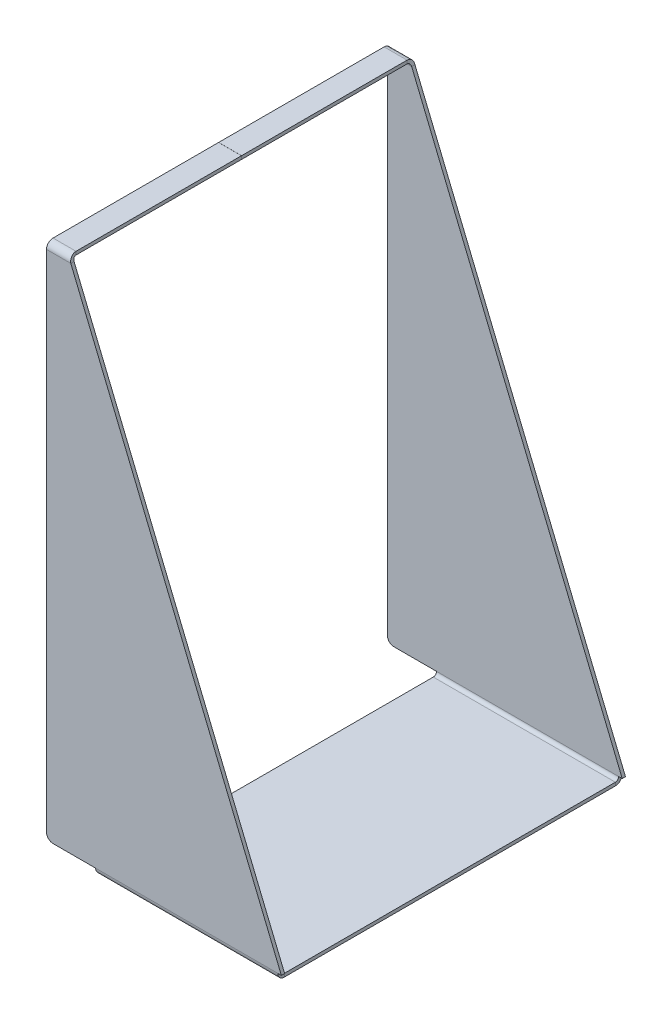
ISO-10303-21;
HEADER;
FILE_DESCRIPTION(('STEP AP214'),'2;1');
FILE_NAME('part.step','',(''),(''),'','','');
FILE_SCHEMA(('AUTOMOTIVE_DESIGN { 1 0 10303 214 1 1 1 1 }'));
ENDSEC;
DATA;
#1=APPLICATION_CONTEXT('core data for automotive mechanical design processes');
#2=APPLICATION_PROTOCOL_DEFINITION('international standard','automotive_design',2000,#1);
#3=PRODUCT_CONTEXT('',#1,'mechanical');
#4=PRODUCT('Part','Part','',(#3));
#5=PRODUCT_RELATED_PRODUCT_CATEGORY('part','',(#4));
#6=PRODUCT_DEFINITION_FORMATION('','',#4);
#7=PRODUCT_DEFINITION_CONTEXT('part definition',#1,'design');
#8=PRODUCT_DEFINITION('design','',#6,#7);
#9=PRODUCT_DEFINITION_SHAPE('','',#8);
#10=(LENGTH_UNIT() NAMED_UNIT(*) SI_UNIT(.MILLI.,.METRE.));
#11=(NAMED_UNIT(*) PLANE_ANGLE_UNIT() SI_UNIT($,.RADIAN.));
#12=(NAMED_UNIT(*) SI_UNIT($,.STERADIAN.) SOLID_ANGLE_UNIT());
#13=UNCERTAINTY_MEASURE_WITH_UNIT(LENGTH_MEASURE(1.E-05),#10,'distance_accuracy_value','');
#14=(GEOMETRIC_REPRESENTATION_CONTEXT(3) GLOBAL_UNCERTAINTY_ASSIGNED_CONTEXT((#13)) GLOBAL_UNIT_ASSIGNED_CONTEXT((#10,
#11,#12)) REPRESENTATION_CONTEXT('',''));
#15=CARTESIAN_POINT('',(0.,0.,0.));
#16=DIRECTION('',(0.,0.,1.));
#17=DIRECTION('',(1.,0.,0.));
#18=AXIS2_PLACEMENT_3D('',#15,#16,#17);
#19=CARTESIAN_POINT('',(-39.8627868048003,-79.1903749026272,103.));
#20=DIRECTION('',(0.,1.,0.));
#21=DIRECTION('',(-1.,0.,0.));
#22=AXIS2_PLACEMENT_3D('',#19,#20,#21);
#23=PLANE('',#22);
#24=DIRECTION('',(0.,0.,1.));
#25=VECTOR('',#24,1.);
#26=CARTESIAN_POINT('',(30.696036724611,-79.1903749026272,103.));
#27=LINE('',#26,#25);
#28=CARTESIAN_POINT('',(30.696036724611,-79.1903749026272,1.));
#29=VERTEX_POINT('',#28);
#30=CARTESIAN_POINT('',(30.696036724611,-79.1903749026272,102.));
#31=VERTEX_POINT('',#30);
#32=EDGE_CURVE('E326',#29,#31,#27,.T.);
#33=ORIENTED_EDGE('',*,*,#32,.T.);
#34=DIRECTION('',(-1.,0.,0.));
#35=VECTOR('',#34,1.);
#36=CARTESIAN_POINT('',(-39.8627868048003,-79.1903749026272,102.));
#37=LINE('',#36,#35);
#38=CARTESIAN_POINT('',(-24.8627868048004,-79.1903749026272,102.));
#39=VERTEX_POINT('',#38);
#40=EDGE_CURVE('E336',#31,#39,#37,.T.);
#41=ORIENTED_EDGE('',*,*,#40,.T.);
#42=DIRECTION('',(0.,0.,-1.));
#43=VECTOR('',#42,1.);
#44=CARTESIAN_POINT('',(-24.8627868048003,-79.1903749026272,106.5));
#45=LINE('',#44,#43);
#46=CARTESIAN_POINT('',(-24.8627868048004,-79.1903749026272,1.));
#47=VERTEX_POINT('',#46);
#48=EDGE_CURVE('E329',#39,#47,#45,.T.);
#49=ORIENTED_EDGE('',*,*,#48,.T.);
#50=DIRECTION('',(1.,0.,0.));
#51=VECTOR('',#50,1.);
#52=CARTESIAN_POINT('',(-39.8627868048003,-79.1903749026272,1.));
#53=LINE('',#52,#51);
#54=EDGE_CURVE('E347',#47,#29,#53,.T.);
#55=ORIENTED_EDGE('',*,*,#54,.T.);
#56=EDGE_LOOP('',(#33,#41,#49,#55));
#57=FACE_BOUND('',#56,.T.);
#58=ADVANCED_FACE('F68',(#57),#23,.F.);
#59=CARTESIAN_POINT('',(-39.8627868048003,-78.1903749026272,103.));
#60=DIRECTION('',(0.,1.,0.));
#61=DIRECTION('',(-1.,0.,0.));
#62=AXIS2_PLACEMENT_3D('',#59,#60,#61);
#63=PLANE('',#62);
#64=DIRECTION('',(-1.,0.,0.));
#65=VECTOR('',#64,1.);
#66=CARTESIAN_POINT('',(-39.8627868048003,-78.1903749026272,102.));
#67=LINE('',#66,#65);
#68=CARTESIAN_POINT('',(30.696036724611,-78.1903749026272,102.));
#69=VERTEX_POINT('',#68);
#70=CARTESIAN_POINT('',(-24.8627868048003,-78.1903749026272,102.));
#71=VERTEX_POINT('',#70);
#72=EDGE_CURVE('E341',#69,#71,#67,.T.);
#73=ORIENTED_EDGE('',*,*,#72,.F.);
#74=DIRECTION('',(0.,0.,1.));
#75=VECTOR('',#74,1.);
#76=CARTESIAN_POINT('',(30.696036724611,-78.1903749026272,104.356194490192));
#77=LINE('',#76,#75);
#78=CARTESIAN_POINT('',(30.696036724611,-78.1903749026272,1.));
#79=VERTEX_POINT('',#78);
#80=EDGE_CURVE('E320',#79,#69,#77,.T.);
#81=ORIENTED_EDGE('',*,*,#80,.F.);
#82=DIRECTION('',(1.,0.,0.));
#83=VECTOR('',#82,1.);
#84=CARTESIAN_POINT('',(32.196036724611,-78.1903749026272,1.));
#85=LINE('',#84,#83);
#86=CARTESIAN_POINT('',(-24.8627868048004,-78.1903749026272,1.));
#87=VERTEX_POINT('',#86);
#88=EDGE_CURVE('E352',#87,#79,#85,.T.);
#89=ORIENTED_EDGE('',*,*,#88,.F.);
#90=DIRECTION('',(0.,0.,1.));
#91=VECTOR('',#90,1.);
#92=CARTESIAN_POINT('',(-24.8627868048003,-78.1903749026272,103.));
#93=LINE('',#92,#91);
#94=EDGE_CURVE('E333',#87,#71,#93,.T.);
#95=ORIENTED_EDGE('',*,*,#94,.T.);
#96=EDGE_LOOP('',(#73,#81,#89,#95));
#97=FACE_BOUND('',#96,.T.);
#98=ADVANCED_FACE('F507',(#97),#63,.T.);
#99=CARTESIAN_POINT('',(-24.8627868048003,-77.1903749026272,106.5));
#100=DIRECTION('',(-1.,0.,0.));
#101=DIRECTION('',(0.,0.,1.));
#102=AXIS2_PLACEMENT_3D('',#99,#100,#101);
#103=PLANE('',#102);
#104=DIRECTION('',(0.,1.,0.));
#105=VECTOR('',#104,1.);
#106=CARTESIAN_POINT('',(-24.8627868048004,-79.1903749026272,1.));
#107=LINE('',#106,#105);
#108=EDGE_CURVE('E349',#47,#87,#107,.T.);
#109=ORIENTED_EDGE('',*,*,#108,.F.);
#110=ORIENTED_EDGE('',*,*,#48,.F.);
#111=DIRECTION('',(0.,1.,0.));
#112=VECTOR('',#111,1.);
#113=CARTESIAN_POINT('',(-24.8627868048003,-79.1903749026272,102.));
#114=LINE('',#113,#112);
#115=EDGE_CURVE('E344',#39,#71,#114,.T.);
#116=ORIENTED_EDGE('',*,*,#115,.T.);
#117=ORIENTED_EDGE('',*,*,#94,.F.);
#118=EDGE_LOOP('',(#109,#110,#116,#117));
#119=FACE_BOUND('',#118,.T.);
#120=ADVANCED_FACE('F484',(#119),#103,.T.);
#121=CARTESIAN_POINT('',(30.696036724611,-78.1903749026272,104.356194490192));
#122=DIRECTION('',(-1.,0.,0.));
#123=DIRECTION('',(0.,0.,1.));
#124=AXIS2_PLACEMENT_3D('',#121,#122,#123);
#125=PLANE('',#124);
#126=ORIENTED_EDGE('',*,*,#80,.T.);
#127=DIRECTION('',(0.,1.,0.));
#128=VECTOR('',#127,1.);
#129=CARTESIAN_POINT('',(30.696036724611,-79.1903749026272,102.));
#130=LINE('',#129,#128);
#131=EDGE_CURVE('E339',#31,#69,#130,.T.);
#132=ORIENTED_EDGE('',*,*,#131,.F.);
#133=ORIENTED_EDGE('',*,*,#32,.F.);
#134=DIRECTION('',(0.,-1.,0.));
#135=VECTOR('',#134,1.);
#136=CARTESIAN_POINT('',(30.696036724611,-78.1903749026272,1.));
#137=LINE('',#136,#135);
#138=EDGE_CURVE('E355',#79,#29,#137,.T.);
#139=ORIENTED_EDGE('',*,*,#138,.F.);
#140=EDGE_LOOP('',(#126,#132,#133,#139));
#141=FACE_BOUND('',#140,.T.);
#142=ADVANCED_FACE('F515',(#141),#125,.F.);
#143=CARTESIAN_POINT('',(30.696036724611,-77.1903749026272,102.));
#144=DIRECTION('',(1.,0.,0.));
#145=DIRECTION('',(0.,0.,-1.));
#146=AXIS2_PLACEMENT_3D('',#143,#144,#145);
#147=PLANE('',#146);
#148=ORIENTED_EDGE('',*,*,#131,.T.);
#149=CARTESIAN_POINT('',(30.696036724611,-77.1903749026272,102.));
#150=DIRECTION('',(-1.,0.,0.));
#151=DIRECTION('',(0.,-1.,0.));
#152=AXIS2_PLACEMENT_3D('',#149,#150,#151);
#153=CIRCLE('',#152,1.);
#154=CARTESIAN_POINT('',(30.696036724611,-77.1903749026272,103.));
#155=VERTEX_POINT('',#154);
#156=EDGE_CURVE('E321',#69,#155,#153,.T.);
#157=ORIENTED_EDGE('',*,*,#156,.T.);
#158=DIRECTION('',(0.,0.,-1.));
#159=VECTOR('',#158,1.);
#160=CARTESIAN_POINT('',(30.696036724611,-77.1903749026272,104.));
#161=LINE('',#160,#159);
#162=CARTESIAN_POINT('',(30.696036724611,-77.1903749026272,104.));
#163=VERTEX_POINT('',#162);
#164=EDGE_CURVE('E453',#163,#155,#161,.T.);
#165=ORIENTED_EDGE('',*,*,#164,.F.);
#166=CARTESIAN_POINT('',(30.696036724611,-77.1903749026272,102.));
#167=DIRECTION('',(-1.,0.,0.));
#168=DIRECTION('',(0.,0.,-1.));
#169=AXIS2_PLACEMENT_3D('',#166,#167,#168);
#170=CIRCLE('',#169,1.99999999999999);
#171=EDGE_CURVE('E313',#31,#163,#170,.T.);
#172=ORIENTED_EDGE('',*,*,#171,.F.);
#173=EDGE_LOOP('',(#148,#157,#165,#172));
#174=FACE_BOUND('',#173,.T.);
#175=ADVANCED_FACE('F475',(#174),#147,.T.);
#176=CARTESIAN_POINT('',(-24.8627868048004,-77.1903749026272,102.));
#177=DIRECTION('',(-1.,0.,0.));
#178=DIRECTION('',(0.,0.,1.));
#179=AXIS2_PLACEMENT_3D('',#176,#177,#178);
#180=PLANE('',#179);
#181=CARTESIAN_POINT('',(-24.8627868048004,-77.1903749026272,102.));
#182=DIRECTION('',(-1.,0.,0.));
#183=DIRECTION('',(0.,-1.,0.));
#184=AXIS2_PLACEMENT_3D('',#181,#182,#183);
#185=CIRCLE('',#184,1.);
#186=CARTESIAN_POINT('',(-24.8627868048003,-77.1903749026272,103.));
#187=VERTEX_POINT('',#186);
#188=EDGE_CURVE('E317',#187,#71,#185,.F.);
#189=ORIENTED_EDGE('',*,*,#188,.T.);
#190=ORIENTED_EDGE('',*,*,#115,.F.);
#191=CARTESIAN_POINT('',(-24.8627868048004,-77.1903749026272,102.));
#192=DIRECTION('',(1.,0.,0.));
#193=DIRECTION('',(0.,0.,-1.));
#194=AXIS2_PLACEMENT_3D('',#191,#192,#193);
#195=CIRCLE('',#194,2.);
#196=CARTESIAN_POINT('',(-24.8627868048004,-77.1903749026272,104.));
#197=VERTEX_POINT('',#196);
#198=EDGE_CURVE('E316',#197,#39,#195,.T.);
#199=ORIENTED_EDGE('',*,*,#198,.F.);
#200=DIRECTION('',(0.,0.,-1.));
#201=VECTOR('',#200,1.);
#202=CARTESIAN_POINT('',(-24.8627868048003,-77.1903749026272,106.5));
#203=LINE('',#202,#201);
#204=EDGE_CURVE('E309',#197,#187,#203,.T.);
#205=ORIENTED_EDGE('',*,*,#204,.T.);
#206=EDGE_LOOP('',(#189,#190,#199,#205));
#207=FACE_BOUND('',#206,.T.);
#208=ADVANCED_FACE('F990',(#207),#180,.T.);
#209=CARTESIAN_POINT('',(58.5343786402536,-77.1903749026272,102.));
#210=DIRECTION('',(-1.,0.,0.));
#211=DIRECTION('',(0.,-1.,0.));
#212=AXIS2_PLACEMENT_3D('',#209,#210,#211);
#213=CYLINDRICAL_SURFACE('',#212,2.);
#214=DIRECTION('',(1.,0.,0.));
#215=VECTOR('',#214,1.);
#216=CARTESIAN_POINT('',(0.,-77.1903749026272,104.));
#217=LINE('',#216,#215);
#218=EDGE_CURVE('E251',#197,#163,#217,.T.);
#219=ORIENTED_EDGE('',*,*,#218,.F.);
#220=ORIENTED_EDGE('',*,*,#198,.T.);
#221=ORIENTED_EDGE('',*,*,#40,.F.);
#222=ORIENTED_EDGE('',*,*,#171,.T.);
#223=EDGE_LOOP('',(#219,#220,#221,#222));
#224=FACE_BOUND('',#223,.T.);
#225=ADVANCED_FACE('F477',(#224),#213,.T.);
#226=CARTESIAN_POINT('',(58.5343786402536,-77.1903749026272,102.));
#227=DIRECTION('',(-1.,0.,0.));
#228=DIRECTION('',(0.,-1.,0.));
#229=AXIS2_PLACEMENT_3D('',#226,#227,#228);
#230=CYLINDRICAL_SURFACE('',#229,1.);
#231=DIRECTION('',(1.,0.,0.));
#232=VECTOR('',#231,1.);
#233=CARTESIAN_POINT('',(0.,-77.1903749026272,103.));
#234=LINE('',#233,#232);
#235=EDGE_CURVE('E305',#187,#155,#234,.T.);
#236=ORIENTED_EDGE('',*,*,#235,.T.);
#237=ORIENTED_EDGE('',*,*,#156,.F.);
#238=ORIENTED_EDGE('',*,*,#72,.T.);
#239=ORIENTED_EDGE('',*,*,#188,.F.);
#240=EDGE_LOOP('',(#236,#237,#238,#239));
#241=FACE_BOUND('',#240,.T.);
#242=ADVANCED_FACE('F529',(#241),#230,.F.);
#243=CARTESIAN_POINT('',(-30.8627868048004,79.8096250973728,51.51));
#244=DIRECTION('',(0.,0.,1.));
#245=DIRECTION('',(-1.,0.,0.));
#246=AXIS2_PLACEMENT_3D('',#243,#244,#245);
#247=PLANE('',#246);
#248=DIRECTION('',(0.,1.,0.));
#249=VECTOR('',#248,1.);
#250=CARTESIAN_POINT('',(-32.8627868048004,79.8096250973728,51.51));
#251=LINE('',#250,#249);
#252=CARTESIAN_POINT('',(-32.8627868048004,79.8096250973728,51.51));
#253=VERTEX_POINT('',#252);
#254=CARTESIAN_POINT('',(-32.8627868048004,80.8096250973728,51.51));
#255=VERTEX_POINT('',#254);
#256=EDGE_CURVE('E300',#253,#255,#251,.T.);
#257=ORIENTED_EDGE('',*,*,#256,.F.);
#258=DIRECTION('',(1.,0.,0.));
#259=VECTOR('',#258,1.);
#260=CARTESIAN_POINT('',(-30.8627868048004,79.8096250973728,51.51));
#261=LINE('',#260,#259);
#262=CARTESIAN_POINT('',(-39.8627868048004,79.8096250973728,51.51));
#263=VERTEX_POINT('',#262);
#264=EDGE_CURVE('E308',#253,#263,#261,.F.);
#265=ORIENTED_EDGE('',*,*,#264,.T.);
#266=DIRECTION('',(0.,-1.,0.));
#267=VECTOR('',#266,1.);
#268=CARTESIAN_POINT('',(-39.8627868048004,79.8096250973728,51.51));
#269=LINE('',#268,#267);
#270=CARTESIAN_POINT('',(-39.8627868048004,80.8096250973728,51.51));
#271=VERTEX_POINT('',#270);
#272=EDGE_CURVE('E304',#263,#271,#269,.F.);
#273=ORIENTED_EDGE('',*,*,#272,.T.);
#274=DIRECTION('',(1.,0.,0.));
#275=VECTOR('',#274,1.);
#276=CARTESIAN_POINT('',(-30.8627868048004,80.8096250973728,51.51));
#277=LINE('',#276,#275);
#278=EDGE_CURVE('E285',#255,#271,#277,.F.);
#279=ORIENTED_EDGE('',*,*,#278,.F.);
#280=EDGE_LOOP('',(#257,#265,#273,#279));
#281=FACE_BOUND('',#280,.T.);
#282=ADVANCED_FACE('F526',(#281),#247,.F.);
#283=CARTESIAN_POINT('',(-32.8627868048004,79.8096250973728,103.));
#284=DIRECTION('',(-1.,0.,0.));
#285=DIRECTION('',(0.,0.,-1.));
#286=AXIS2_PLACEMENT_3D('',#283,#284,#285);
#287=PLANE('',#286);
#288=DIRECTION('',(0.,1.,0.));
#289=VECTOR('',#288,1.);
#290=CARTESIAN_POINT('',(-32.8627868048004,79.8096250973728,102.));
#291=LINE('',#290,#289);
#292=CARTESIAN_POINT('',(-32.8627868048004,79.8096250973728,102.));
#293=VERTEX_POINT('',#292);
#294=CARTESIAN_POINT('',(-32.8627868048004,80.8096250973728,102.));
#295=VERTEX_POINT('',#294);
#296=EDGE_CURVE('E280',#293,#295,#291,.T.);
#297=ORIENTED_EDGE('',*,*,#296,.F.);
#298=DIRECTION('',(0.,0.,-1.));
#299=VECTOR('',#298,1.);
#300=CARTESIAN_POINT('',(-32.8627868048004,79.8096250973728,103.));
#301=LINE('',#300,#299);
#302=EDGE_CURVE('E301',#293,#253,#301,.T.);
#303=ORIENTED_EDGE('',*,*,#302,.T.);
#304=ORIENTED_EDGE('',*,*,#256,.T.);
#305=DIRECTION('',(0.,0.,-1.));
#306=VECTOR('',#305,1.);
#307=CARTESIAN_POINT('',(-32.8627868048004,80.8096250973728,103.));
#308=LINE('',#307,#306);
#309=EDGE_CURVE('E286',#295,#255,#308,.T.);
#310=ORIENTED_EDGE('',*,*,#309,.F.);
#311=EDGE_LOOP('',(#297,#303,#304,#310));
#312=FACE_BOUND('',#311,.T.);
#313=ADVANCED_FACE('F528',(#312),#287,.F.);
#314=CARTESIAN_POINT('',(-39.8627868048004,78.8096250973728,102.));
#315=DIRECTION('',(-1.,0.,0.));
#316=DIRECTION('',(0.,-1.,0.));
#317=AXIS2_PLACEMENT_3D('',#314,#315,#316);
#318=PLANE('',#317);
#319=DIRECTION('',(0.,0.,-1.));
#320=VECTOR('',#319,1.);
#321=CARTESIAN_POINT('',(-39.8627868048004,79.8096250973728,103.));
#322=LINE('',#321,#320);
#323=CARTESIAN_POINT('',(-39.8627868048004,79.8096250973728,102.));
#324=VERTEX_POINT('',#323);
#325=EDGE_CURVE('E292',#324,#263,#322,.T.);
#326=ORIENTED_EDGE('',*,*,#325,.F.);
#327=DIRECTION('',(0.,1.,0.));
#328=VECTOR('',#327,1.);
#329=CARTESIAN_POINT('',(-39.8627868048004,79.8096250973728,102.));
#330=LINE('',#329,#328);
#331=CARTESIAN_POINT('',(-39.8627868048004,80.8096250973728,102.));
#332=VERTEX_POINT('',#331);
#333=EDGE_CURVE('E298',#324,#332,#330,.T.);
#334=ORIENTED_EDGE('',*,*,#333,.T.);
#335=DIRECTION('',(0.,0.,-1.));
#336=VECTOR('',#335,1.);
#337=CARTESIAN_POINT('',(-39.8627868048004,80.8096250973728,103.));
#338=LINE('',#337,#336);
#339=EDGE_CURVE('E295',#332,#271,#338,.T.);
#340=ORIENTED_EDGE('',*,*,#339,.T.);
#341=ORIENTED_EDGE('',*,*,#272,.F.);
#342=EDGE_LOOP('',(#326,#334,#340,#341));
#343=FACE_BOUND('',#342,.T.);
#344=ADVANCED_FACE('F535',(#343),#318,.T.);
#345=CARTESIAN_POINT('',(-32.8627868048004,79.8096250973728,103.));
#346=DIRECTION('',(0.,-1.,0.));
#347=DIRECTION('',(0.,0.,-1.));
#348=AXIS2_PLACEMENT_3D('',#345,#346,#347);
#349=PLANE('',#348);
#350=ORIENTED_EDGE('',*,*,#325,.T.);
#351=ORIENTED_EDGE('',*,*,#264,.F.);
#352=ORIENTED_EDGE('',*,*,#302,.F.);
#353=DIRECTION('',(-1.,0.,0.));
#354=VECTOR('',#353,1.);
#355=CARTESIAN_POINT('',(-32.8627868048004,79.8096250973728,102.));
#356=LINE('',#355,#354);
#357=EDGE_CURVE('E271',#324,#293,#356,.F.);
#358=ORIENTED_EDGE('',*,*,#357,.F.);
#359=EDGE_LOOP('',(#350,#351,#352,#358));
#360=FACE_BOUND('',#359,.T.);
#361=ADVANCED_FACE('F545',(#360),#349,.T.);
#362=CARTESIAN_POINT('',(-32.8627868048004,80.8096250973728,103.));
#363=DIRECTION('',(0.,-1.,0.));
#364=DIRECTION('',(0.,0.,-1.));
#365=AXIS2_PLACEMENT_3D('',#362,#363,#364);
#366=PLANE('',#365);
#367=ORIENTED_EDGE('',*,*,#339,.F.);
#368=DIRECTION('',(1.,0.,0.));
#369=VECTOR('',#368,1.);
#370=CARTESIAN_POINT('',(-32.8627868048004,80.8096250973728,102.));
#371=LINE('',#370,#369);
#372=EDGE_CURVE('E289',#332,#295,#371,.T.);
#373=ORIENTED_EDGE('',*,*,#372,.T.);
#374=ORIENTED_EDGE('',*,*,#309,.T.);
#375=ORIENTED_EDGE('',*,*,#278,.T.);
#376=EDGE_LOOP('',(#367,#373,#374,#375));
#377=FACE_BOUND('',#376,.T.);
#378=ADVANCED_FACE('F552',(#377),#366,.F.);
#379=CARTESIAN_POINT('',(-32.8627868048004,80.8096250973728,102.));
#380=CARTESIAN_POINT('',(-32.8627868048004,80.4762917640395,102.));
#381=CARTESIAN_POINT('',(-32.8627868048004,80.1429584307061,102.));
#382=CARTESIAN_POINT('',(-32.8627868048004,79.8096250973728,102.));
#383=CARTESIAN_POINT('',(-32.8627868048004,80.8096250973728,98.));
#384=CARTESIAN_POINT('',(-32.8627868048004,80.4762917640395,98.6666666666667));
#385=CARTESIAN_POINT('',(-32.8627868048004,80.1429584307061,99.3333333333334));
#386=CARTESIAN_POINT('',(-32.8627868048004,79.8096250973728,100.));
#387=CARTESIAN_POINT('',(-32.0392573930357,76.8096250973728,98.));
#388=CARTESIAN_POINT('',(-32.0392573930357,77.1429584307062,98.6666666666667));
#389=CARTESIAN_POINT('',(-32.0392573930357,77.4762917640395,99.3333333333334));
#390=CARTESIAN_POINT('',(-32.0392573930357,77.8096250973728,100.));
#391=CARTESIAN_POINT('',(-32.0392573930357,76.8096250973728,102.));
#392=CARTESIAN_POINT('',(-32.0392573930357,77.1429584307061,102.));
#393=CARTESIAN_POINT('',(-32.0392573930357,77.4762917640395,102.));
#394=CARTESIAN_POINT('',(-32.0392573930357,77.8096250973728,102.));
#395=CARTESIAN_POINT('',(-32.0392573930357,76.8096250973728,106.));
#396=CARTESIAN_POINT('',(-32.0392573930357,77.1429584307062,105.333333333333));
#397=CARTESIAN_POINT('',(-32.0392573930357,77.4762917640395,104.666666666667));
#398=CARTESIAN_POINT('',(-32.0392573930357,77.8096250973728,104.));
#399=CARTESIAN_POINT('',(-32.8627868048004,80.8096250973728,106.));
#400=CARTESIAN_POINT('',(-32.8627868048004,80.4762917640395,105.333333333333));
#401=CARTESIAN_POINT('',(-32.8627868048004,80.1429584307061,104.666666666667));
#402=CARTESIAN_POINT('',(-32.8627868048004,79.8096250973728,104.));
#403=CARTESIAN_POINT('',(-32.8627868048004,80.8096250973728,102.));
#404=CARTESIAN_POINT('',(-32.8627868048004,80.4762917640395,102.));
#405=CARTESIAN_POINT('',(-32.8627868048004,80.1429584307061,102.));
#406=CARTESIAN_POINT('',(-32.8627868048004,79.8096250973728,102.));
#407=(BOUNDED_SURFACE() B_SPLINE_SURFACE(3,3,((#379,#380,#381,#382),(#383,#384,#385,#386),(#387,
#388,#389,#390),(#391,#392,#393,#394),(#395,#396,#397,#398),(#399,#400,#401,#402),(#403,#404,
#405,#406)),.UNSPECIFIED.,.T.,.F.,.F.) B_SPLINE_SURFACE_WITH_KNOTS((4,3,4),(4,4),(0.,0.5,1.),
(0.,1.),.UNSPECIFIED.) GEOMETRIC_REPRESENTATION_ITEM() RATIONAL_B_SPLINE_SURFACE(((1.,1.,1.,1.),
(0.333333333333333,0.333333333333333,0.333333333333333,0.333333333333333),(0.333333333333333,
0.333333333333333,0.333333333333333,0.333333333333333),(1.,1.,1.,1.),(0.333333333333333,
0.333333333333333,0.333333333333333,0.333333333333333),(0.333333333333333,0.333333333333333,
0.333333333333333,0.333333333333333),(1.,1.,1.,1.))) REPRESENTATION_ITEM('') SURFACE());
#408=DIRECTION('',(0.,0.,1.));
#409=VECTOR('',#408,1.);
#410=CARTESIAN_POINT('',(-32.451022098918,78.8096250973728,103.));
#411=LINE('',#410,#409);
#412=CARTESIAN_POINT('',(-32.451022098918,78.8096250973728,103.));
#413=VERTEX_POINT('',#412);
#414=CARTESIAN_POINT('',(-32.451022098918,78.8096250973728,104.));
#415=VERTEX_POINT('',#414);
#416=EDGE_CURVE('E257',#413,#415,#411,.T.);
#417=CARTESIAN_POINT('',(-32.451022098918,78.8096250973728,102.));
#418=DIRECTION('',(0.924678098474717,0.380749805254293,0.));
#419=DIRECTION('',(-0.380749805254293,0.924678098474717,0.));
#420=AXIS2_PLACEMENT_3D('',#417,#418,#419);
#421=ELLIPSE('',#420,1.08145743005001,1.);
#422=EDGE_CURVE('E282',#413,#293,#421,.F.);
#423=CARTESIAN_POINT('',(-32.451022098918,78.8096250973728,102.));
#424=DIRECTION('',(0.979457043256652,0.201652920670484,0.));
#425=DIRECTION('',(-0.201652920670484,0.979457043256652,0.));
#426=AXIS2_PLACEMENT_3D('',#423,#424,#425);
#427=ELLIPSE('',#426,2.0419476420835,2.);
#428=EDGE_CURVE('E268',#415,#295,#427,.F.);
#429=ORIENTED_EDGE('',*,*,#416,.F.);
#430=ORIENTED_EDGE('',*,*,#422,.T.);
#431=ORIENTED_EDGE('',*,*,#296,.T.);
#432=ORIENTED_EDGE('',*,*,#428,.F.);
#433=EDGE_LOOP('',(#429,#430,#431,#432));
#434=FACE_BOUND('',#433,.T.);
#435=ADVANCED_FACE('F557',(#434),#407,.F.);
#436=DIRECTION('',(0.,0.,-1.));
#437=VECTOR('',#436,1.);
#438=CARTESIAN_POINT('',(-39.8627868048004,78.8096250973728,104.));
#439=LINE('',#438,#437);
#440=CARTESIAN_POINT('',(-39.8627868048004,78.8096250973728,104.));
#441=VERTEX_POINT('',#440);
#442=CARTESIAN_POINT('',(-39.8627868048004,78.8096250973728,103.));
#443=VERTEX_POINT('',#442);
#444=EDGE_CURVE('E249',#441,#443,#439,.T.);
#445=ORIENTED_EDGE('',*,*,#444,.F.);
#446=CARTESIAN_POINT('',(-39.8627868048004,78.8096250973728,102.));
#447=DIRECTION('',(-1.,0.,0.));
#448=DIRECTION('',(0.,0.,1.));
#449=AXIS2_PLACEMENT_3D('',#446,#447,#448);
#450=CIRCLE('',#449,2.);
#451=EDGE_CURVE('E265',#332,#441,#450,.F.);
#452=ORIENTED_EDGE('',*,*,#451,.F.);
#453=ORIENTED_EDGE('',*,*,#333,.F.);
#454=CARTESIAN_POINT('',(-39.8627868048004,78.8096250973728,102.));
#455=DIRECTION('',(1.,0.,0.));
#456=DIRECTION('',(0.,1.,0.));
#457=AXIS2_PLACEMENT_3D('',#454,#455,#456);
#458=CIRCLE('',#457,1.);
#459=EDGE_CURVE('E277',#324,#443,#458,.T.);
#460=ORIENTED_EDGE('',*,*,#459,.T.);
#461=EDGE_LOOP('',(#445,#452,#453,#460));
#462=FACE_BOUND('',#461,.T.);
#463=ADVANCED_FACE('F566',(#462),#318,.T.);
#464=CARTESIAN_POINT('',(0.,78.8096250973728,102.));
#465=DIRECTION('',(-1.,0.,0.));
#466=DIRECTION('',(0.,0.,1.));
#467=AXIS2_PLACEMENT_3D('',#464,#465,#466);
#468=CYLINDRICAL_SURFACE('',#467,1.);
#469=ORIENTED_EDGE('',*,*,#422,.F.);
#470=DIRECTION('',(-1.,0.,0.));
#471=VECTOR('',#470,1.);
#472=CARTESIAN_POINT('',(0.,78.8096250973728,103.));
#473=LINE('',#472,#471);
#474=EDGE_CURVE('E274',#413,#443,#473,.T.);
#475=ORIENTED_EDGE('',*,*,#474,.T.);
#476=ORIENTED_EDGE('',*,*,#459,.F.);
#477=ORIENTED_EDGE('',*,*,#357,.T.);
#478=EDGE_LOOP('',(#469,#475,#476,#477));
#479=FACE_BOUND('',#478,.T.);
#480=ADVANCED_FACE('F561',(#479),#468,.F.);
#481=CARTESIAN_POINT('',(0.,78.8096250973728,102.));
#482=DIRECTION('',(-1.,0.,0.));
#483=DIRECTION('',(0.,0.,1.));
#484=AXIS2_PLACEMENT_3D('',#481,#482,#483);
#485=CYLINDRICAL_SURFACE('',#484,2.);
#486=ORIENTED_EDGE('',*,*,#428,.T.);
#487=ORIENTED_EDGE('',*,*,#372,.F.);
#488=ORIENTED_EDGE('',*,*,#451,.T.);
#489=DIRECTION('',(-1.,0.,0.));
#490=VECTOR('',#489,1.);
#491=CARTESIAN_POINT('',(0.,78.8096250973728,104.));
#492=LINE('',#491,#490);
#493=EDGE_CURVE('E247',#415,#441,#492,.T.);
#494=ORIENTED_EDGE('',*,*,#493,.F.);
#495=EDGE_LOOP('',(#486,#487,#488,#494));
#496=FACE_BOUND('',#495,.T.);
#497=ADVANCED_FACE('F431',(#496),#485,.T.);
#498=CARTESIAN_POINT('',(32.196036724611,-78.1903749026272,103.));
#499=DIRECTION('',(-0.924678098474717,-0.380749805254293,0.));
#500=DIRECTION('',(-0.380749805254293,0.924678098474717,0.));
#501=AXIS2_PLACEMENT_3D('',#498,#499,#500);
#502=PLANE('',#501);
#503=CARTESIAN_POINT('',(31.7842720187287,-77.1903749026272,104.));
#504=DIRECTION('',(0.,0.,-1.));
#505=VECTOR('',#504,1.);
#506=LINE('',#503,#505);
#507=CARTESIAN_POINT('',(31.7842720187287,-77.1903749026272,104.));
#508=VERTEX_POINT('',#507);
#509=CARTESIAN_POINT('',(31.7842720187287,-77.1903749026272,103.));
#510=VERTEX_POINT('',#509);
#511=EDGE_CURVE('E262',#508,#510,#506,.T.);
#512=ORIENTED_EDGE('',*,*,#511,.T.);
#513=DIRECTION('',(-0.380749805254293,0.924678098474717,0.));
#514=VECTOR('',#513,1.);
#515=CARTESIAN_POINT('',(32.196036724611,-78.1903749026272,103.));
#516=LINE('',#515,#514);
#517=EDGE_CURVE('E259',#510,#413,#516,.T.);
#518=ORIENTED_EDGE('',*,*,#517,.T.);
#519=ORIENTED_EDGE('',*,*,#416,.T.);
#520=DIRECTION('',(-0.380749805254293,0.924678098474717,0.));
#521=VECTOR('',#520,1.);
#522=CARTESIAN_POINT('',(32.196036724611,-78.1903749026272,104.));
#523=LINE('',#522,#521);
#524=EDGE_CURVE('E459',#508,#415,#523,.T.);
#525=ORIENTED_EDGE('',*,*,#524,.F.);
#526=EDGE_LOOP('',(#512,#518,#519,#525));
#527=FACE_BOUND('',#526,.T.);
#528=ADVANCED_FACE('F421',(#527),#502,.F.);
#529=DIRECTION('',(0.,-1.,0.));
#530=VECTOR('',#529,1.);
#531=CARTESIAN_POINT('',(-39.8627868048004,79.8096250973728,103.));
#532=LINE('',#531,#530);
#533=CARTESIAN_POINT('',(-39.8627868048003,-75.1903749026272,103.));
#534=VERTEX_POINT('',#533);
#535=EDGE_CURVE('E241',#443,#534,#532,.T.);
#536=ORIENTED_EDGE('',*,*,#535,.T.);
#537=DIRECTION('',(0.,0.,1.));
#538=VECTOR('',#537,1.);
#539=CARTESIAN_POINT('',(-39.8627868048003,-75.1903749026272,102.));
#540=LINE('',#539,#538);
#541=CARTESIAN_POINT('',(-39.8627868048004,-75.1903749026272,104.));
#542=VERTEX_POINT('',#541);
#543=EDGE_CURVE('E230',#534,#542,#540,.T.);
#544=ORIENTED_EDGE('',*,*,#543,.T.);
#545=DIRECTION('',(0.,1.,0.));
#546=VECTOR('',#545,1.);
#547=CARTESIAN_POINT('',(-39.8627868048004,0.,104.));
#548=LINE('',#547,#546);
#549=EDGE_CURVE('E238',#441,#542,#548,.F.);
#550=ORIENTED_EDGE('',*,*,#549,.F.);
#551=ORIENTED_EDGE('',*,*,#444,.T.);
#552=EDGE_LOOP('',(#536,#544,#550,#551));
#553=FACE_BOUND('',#552,.T.);
#554=ADVANCED_FACE('F237',(#553),#318,.T.);
#555=CARTESIAN_POINT('',(0.,0.,104.));
#556=DIRECTION('',(0.,0.,-1.));
#557=DIRECTION('',(-1.,0.,0.));
#558=AXIS2_PLACEMENT_3D('',#555,#556,#557);
#559=PLANE('',#558);
#560=ORIENTED_EDGE('',*,*,#549,.T.);
#561=CARTESIAN_POINT('',(-37.8627868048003,-75.1903749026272,104.));
#562=DIRECTION('',(0.,0.,-1.));
#563=DIRECTION('',(-1.,0.,0.));
#564=AXIS2_PLACEMENT_3D('',#561,#562,#563);
#565=CIRCLE('',#564,2.);
#566=CARTESIAN_POINT('',(-37.8627868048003,-77.1903749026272,104.));
#567=VERTEX_POINT('',#566);
#568=EDGE_CURVE('E226',#542,#567,#565,.F.);
#569=ORIENTED_EDGE('',*,*,#568,.T.);
#570=DIRECTION('',(-1.,0.,0.));
#571=VECTOR('',#570,1.);
#572=CARTESIAN_POINT('',(0.,-77.1903749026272,104.));
#573=LINE('',#572,#571);
#574=EDGE_CURVE('E248',#567,#197,#573,.F.);
#575=ORIENTED_EDGE('',*,*,#574,.T.);
#576=ORIENTED_EDGE('',*,*,#218,.T.);
#577=DIRECTION('',(1.,0.,0.));
#578=VECTOR('',#577,1.);
#579=CARTESIAN_POINT('',(0.,-77.1903749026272,104.));
#580=LINE('',#579,#578);
#581=EDGE_CURVE('E461',#163,#508,#580,.T.);
#582=ORIENTED_EDGE('',*,*,#581,.T.);
#583=ORIENTED_EDGE('',*,*,#524,.T.);
#584=ORIENTED_EDGE('',*,*,#493,.T.);
#585=EDGE_LOOP('',(#560,#569,#575,#576,#582,#583,#584));
#586=FACE_BOUND('',#585,.T.);
#587=ADVANCED_FACE('F244',(#586),#559,.F.);
#588=CARTESIAN_POINT('',(0.,-77.1903749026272,104.));
#589=DIRECTION('',(0.,-1.,0.));
#590=DIRECTION('',(1.,0.,0.));
#591=AXIS2_PLACEMENT_3D('',#588,#589,#590);
#592=PLANE('',#591);
#593=ORIENTED_EDGE('',*,*,#511,.F.);
#594=ORIENTED_EDGE('',*,*,#581,.F.);
#595=ORIENTED_EDGE('',*,*,#164,.T.);
#596=DIRECTION('',(1.,0.,0.));
#597=VECTOR('',#596,1.);
#598=CARTESIAN_POINT('',(3.66662495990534,-77.1903749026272,103.));
#599=LINE('',#598,#597);
#600=EDGE_CURVE('E451',#155,#510,#599,.T.);
#601=ORIENTED_EDGE('',*,*,#600,.T.);
#602=EDGE_LOOP('',(#593,#594,#595,#601));
#603=FACE_BOUND('',#602,.T.);
#604=ADVANCED_FACE('F435',(#603),#592,.T.);
#605=CARTESIAN_POINT('',(0.,0.,103.));
#606=DIRECTION('',(0.,0.,-1.));
#607=DIRECTION('',(-1.,0.,0.));
#608=AXIS2_PLACEMENT_3D('',#605,#606,#607);
#609=PLANE('',#608);
#610=DIRECTION('',(1.,0.,0.));
#611=VECTOR('',#610,1.);
#612=CARTESIAN_POINT('',(0.,-77.1903749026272,103.));
#613=LINE('',#612,#611);
#614=CARTESIAN_POINT('',(-37.8627868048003,-77.1903749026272,103.));
#615=VERTEX_POINT('',#614);
#616=EDGE_CURVE('E324',#615,#187,#613,.T.);
#617=ORIENTED_EDGE('',*,*,#616,.F.);
#618=CARTESIAN_POINT('',(-37.8627868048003,-75.1903749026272,103.));
#619=DIRECTION('',(0.,0.,-1.));
#620=DIRECTION('',(-1.,0.,0.));
#621=AXIS2_PLACEMENT_3D('',#618,#619,#620);
#622=CIRCLE('',#621,2.);
#623=EDGE_CURVE('E14',#615,#534,#622,.T.);
#624=ORIENTED_EDGE('',*,*,#623,.T.);
#625=ORIENTED_EDGE('',*,*,#535,.F.);
#626=ORIENTED_EDGE('',*,*,#474,.F.);
#627=ORIENTED_EDGE('',*,*,#517,.F.);
#628=ORIENTED_EDGE('',*,*,#600,.F.);
#629=ORIENTED_EDGE('',*,*,#235,.F.);
#630=EDGE_LOOP('',(#617,#624,#625,#626,#627,#628,#629));
#631=FACE_BOUND('',#630,.T.);
#632=ADVANCED_FACE('F439',(#631),#609,.T.);
#633=CARTESIAN_POINT('',(0.,-77.1903749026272,0.));
#634=DIRECTION('',(0.,-1.,0.));
#635=DIRECTION('',(0.,0.,-1.));
#636=AXIS2_PLACEMENT_3D('',#633,#634,#635);
#637=PLANE('',#636);
#638=ORIENTED_EDGE('',*,*,#574,.F.);
#639=DIRECTION('',(0.,0.,1.));
#640=VECTOR('',#639,1.);
#641=CARTESIAN_POINT('',(-37.8627868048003,-77.1903749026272,0.));
#642=LINE('',#641,#640);
#643=EDGE_CURVE('E78',#567,#615,#642,.F.);
#644=ORIENTED_EDGE('',*,*,#643,.T.);
#645=ORIENTED_EDGE('',*,*,#616,.T.);
#646=ORIENTED_EDGE('',*,*,#204,.F.);
#647=EDGE_LOOP('',(#638,#644,#645,#646));
#648=FACE_BOUND('',#647,.T.);
#649=ADVANCED_FACE('F502',(#648),#637,.T.);
#650=CARTESIAN_POINT('',(30.696036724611,-77.1903749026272,1.));
#651=DIRECTION('',(1.,0.,0.));
#652=DIRECTION('',(0.,0.,-1.));
#653=AXIS2_PLACEMENT_3D('',#650,#651,#652);
#654=PLANE('',#653);
#655=DIRECTION('',(0.,0.,-1.));
#656=VECTOR('',#655,1.);
#657=CARTESIAN_POINT('',(30.696036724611,-77.1903749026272,0.));
#658=LINE('',#657,#656);
#659=CARTESIAN_POINT('',(30.696036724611,-77.1903749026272,0.));
#660=VERTEX_POINT('',#659);
#661=CARTESIAN_POINT('',(30.696036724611,-77.1903749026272,-0.999999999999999));
#662=VERTEX_POINT('',#661);
#663=EDGE_CURVE('E410',#660,#662,#658,.T.);
#664=ORIENTED_EDGE('',*,*,#663,.F.);
#665=CARTESIAN_POINT('',(30.6960367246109,-77.1903749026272,1.));
#666=DIRECTION('',(1.,0.,0.));
#667=DIRECTION('',(0.,1.,0.));
#668=AXIS2_PLACEMENT_3D('',#665,#666,#667);
#669=CIRCLE('',#668,1.);
#670=EDGE_CURVE('E407',#660,#79,#669,.F.);
#671=ORIENTED_EDGE('',*,*,#670,.T.);
#672=ORIENTED_EDGE('',*,*,#138,.T.);
#673=CARTESIAN_POINT('',(30.696036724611,-77.1903749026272,1.));
#674=DIRECTION('',(-1.,0.,0.));
#675=DIRECTION('',(0.,0.,1.));
#676=AXIS2_PLACEMENT_3D('',#673,#674,#675);
#677=CIRCLE('',#676,2.);
#678=EDGE_CURVE('E402',#662,#29,#677,.T.);
#679=ORIENTED_EDGE('',*,*,#678,.F.);
#680=EDGE_LOOP('',(#664,#671,#672,#679));
#681=FACE_BOUND('',#680,.T.);
#682=ADVANCED_FACE('F494',(#681),#654,.T.);
#683=CARTESIAN_POINT('',(-24.8627868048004,-77.1903749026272,1.));
#684=DIRECTION('',(-1.,0.,0.));
#685=DIRECTION('',(0.,0.,1.));
#686=AXIS2_PLACEMENT_3D('',#683,#684,#685);
#687=PLANE('',#686);
#688=CARTESIAN_POINT('',(-24.8627868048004,-77.1903749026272,1.));
#689=DIRECTION('',(1.,0.,0.));
#690=DIRECTION('',(0.,1.,0.));
#691=AXIS2_PLACEMENT_3D('',#688,#689,#690);
#692=CIRCLE('',#691,1.);
#693=CARTESIAN_POINT('',(-24.8627868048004,-77.1903749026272,0.));
#694=VERTEX_POINT('',#693);
#695=EDGE_CURVE('E405',#87,#694,#692,.T.);
#696=ORIENTED_EDGE('',*,*,#695,.T.);
#697=DIRECTION('',(0.,0.,-1.));
#698=VECTOR('',#697,1.);
#699=CARTESIAN_POINT('',(-24.8627868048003,-77.1903749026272,106.5));
#700=LINE('',#699,#698);
#701=CARTESIAN_POINT('',(-24.8627868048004,-77.1903749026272,-1.));
#702=VERTEX_POINT('',#701);
#703=EDGE_CURVE('E387',#694,#702,#700,.T.);
#704=ORIENTED_EDGE('',*,*,#703,.T.);
#705=CARTESIAN_POINT('',(-24.8627868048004,-77.1903749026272,1.));
#706=DIRECTION('',(1.,0.,0.));
#707=DIRECTION('',(0.,0.,-1.));
#708=AXIS2_PLACEMENT_3D('',#705,#706,#707);
#709=CIRCLE('',#708,2.00000000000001);
#710=EDGE_CURVE('E312',#47,#702,#709,.T.);
#711=ORIENTED_EDGE('',*,*,#710,.F.);
#712=ORIENTED_EDGE('',*,*,#108,.T.);
#713=EDGE_LOOP('',(#696,#704,#711,#712));
#714=FACE_BOUND('',#713,.T.);
#715=ADVANCED_FACE('F492',(#714),#687,.T.);
#716=CARTESIAN_POINT('',(-52.7011287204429,-77.1903749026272,1.));
#717=DIRECTION('',(1.,0.,0.));
#718=DIRECTION('',(0.,1.,0.));
#719=AXIS2_PLACEMENT_3D('',#716,#717,#718);
#720=CYLINDRICAL_SURFACE('',#719,2.);
#721=ORIENTED_EDGE('',*,*,#54,.F.);
#722=ORIENTED_EDGE('',*,*,#710,.T.);
#723=DIRECTION('',(-1.,0.,0.));
#724=VECTOR('',#723,1.);
#725=CARTESIAN_POINT('',(0.,-77.1903749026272,-0.999999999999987));
#726=LINE('',#725,#724);
#727=EDGE_CURVE('E1082',#662,#702,#726,.T.);
#728=ORIENTED_EDGE('',*,*,#727,.F.);
#729=ORIENTED_EDGE('',*,*,#678,.T.);
#730=EDGE_LOOP('',(#721,#722,#728,#729));
#731=FACE_BOUND('',#730,.T.);
#732=ADVANCED_FACE('F489',(#731),#720,.T.);
#733=CARTESIAN_POINT('',(-52.7011287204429,-77.1903749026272,1.));
#734=DIRECTION('',(1.,0.,0.));
#735=DIRECTION('',(0.,1.,0.));
#736=AXIS2_PLACEMENT_3D('',#733,#734,#735);
#737=CYLINDRICAL_SURFACE('',#736,1.);
#738=ORIENTED_EDGE('',*,*,#88,.T.);
#739=ORIENTED_EDGE('',*,*,#670,.F.);
#740=DIRECTION('',(-1.,0.,0.));
#741=VECTOR('',#740,1.);
#742=CARTESIAN_POINT('',(-39.8627868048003,-77.1903749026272,0.));
#743=LINE('',#742,#741);
#744=EDGE_CURVE('E391',#660,#694,#743,.T.);
#745=ORIENTED_EDGE('',*,*,#744,.T.);
#746=ORIENTED_EDGE('',*,*,#695,.F.);
#747=EDGE_LOOP('',(#738,#739,#745,#746));
#748=FACE_BOUND('',#747,.T.);
#749=ADVANCED_FACE('F500',(#748),#737,.F.);
#750=CARTESIAN_POINT('',(-30.8627868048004,79.8096250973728,51.49));
#751=DIRECTION('',(0.,0.,1.));
#752=DIRECTION('',(-1.,0.,0.));
#753=AXIS2_PLACEMENT_3D('',#750,#751,#752);
#754=PLANE('',#753);
#755=DIRECTION('',(0.,1.,0.));
#756=VECTOR('',#755,1.);
#757=CARTESIAN_POINT('',(-39.8627868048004,78.8096250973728,51.49));
#758=LINE('',#757,#756);
#759=CARTESIAN_POINT('',(-39.8627868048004,79.8096250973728,51.49));
#760=VERTEX_POINT('',#759);
#761=CARTESIAN_POINT('',(-39.8627868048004,80.8096250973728,51.49));
#762=VERTEX_POINT('',#761);
#763=EDGE_CURVE('E373',#760,#762,#758,.T.);
#764=ORIENTED_EDGE('',*,*,#763,.F.);
#765=DIRECTION('',(1.,0.,0.));
#766=VECTOR('',#765,1.);
#767=CARTESIAN_POINT('',(-30.8627868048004,79.8096250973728,51.49));
#768=LINE('',#767,#766);
#769=CARTESIAN_POINT('',(-32.8627868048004,79.8096250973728,51.49));
#770=VERTEX_POINT('',#769);
#771=EDGE_CURVE('E72',#760,#770,#768,.T.);
#772=ORIENTED_EDGE('',*,*,#771,.T.);
#773=DIRECTION('',(0.,-1.,0.));
#774=VECTOR('',#773,1.);
#775=CARTESIAN_POINT('',(-32.8627868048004,79.8096250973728,51.49));
#776=LINE('',#775,#774);
#777=CARTESIAN_POINT('',(-32.8627868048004,80.8096250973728,51.49));
#778=VERTEX_POINT('',#777);
#779=EDGE_CURVE('E121',#770,#778,#776,.F.);
#780=ORIENTED_EDGE('',*,*,#779,.T.);
#781=DIRECTION('',(1.,0.,0.));
#782=VECTOR('',#781,1.);
#783=CARTESIAN_POINT('',(-30.8627868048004,80.8096250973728,51.49));
#784=LINE('',#783,#782);
#785=EDGE_CURVE('E377',#762,#778,#784,.T.);
#786=ORIENTED_EDGE('',*,*,#785,.F.);
#787=EDGE_LOOP('',(#764,#772,#780,#786));
#788=FACE_BOUND('',#787,.T.);
#789=ADVANCED_FACE('F70',(#788),#754,.T.);
#790=CARTESIAN_POINT('',(-39.8627868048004,78.8096250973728,102.));
#791=DIRECTION('',(-1.,0.,0.));
#792=DIRECTION('',(0.,-1.,0.));
#793=AXIS2_PLACEMENT_3D('',#790,#791,#792);
#794=PLANE('',#793);
#795=DIRECTION('',(0.,0.,-1.));
#796=VECTOR('',#795,1.);
#797=CARTESIAN_POINT('',(-39.8627868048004,80.8096250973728,103.));
#798=LINE('',#797,#796);
#799=CARTESIAN_POINT('',(-39.8627868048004,80.8096250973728,1.00000000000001));
#800=VERTEX_POINT('',#799);
#801=EDGE_CURVE('E381',#762,#800,#798,.T.);
#802=ORIENTED_EDGE('',*,*,#801,.T.);
#803=DIRECTION('',(0.,-1.,0.));
#804=VECTOR('',#803,1.);
#805=CARTESIAN_POINT('',(-39.8627868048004,80.8096250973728,1.00000000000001));
#806=LINE('',#805,#804);
#807=CARTESIAN_POINT('',(-39.8627868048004,79.8096250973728,1.00000000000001));
#808=VERTEX_POINT('',#807);
#809=EDGE_CURVE('E376',#800,#808,#806,.T.);
#810=ORIENTED_EDGE('',*,*,#809,.T.);
#811=DIRECTION('',(0.,0.,-1.));
#812=VECTOR('',#811,1.);
#813=CARTESIAN_POINT('',(-39.8627868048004,79.8096250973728,103.));
#814=LINE('',#813,#812);
#815=EDGE_CURVE('E1124',#760,#808,#814,.T.);
#816=ORIENTED_EDGE('',*,*,#815,.F.);
#817=ORIENTED_EDGE('',*,*,#763,.T.);
#818=EDGE_LOOP('',(#802,#810,#816,#817));
#819=FACE_BOUND('',#818,.T.);
#820=ADVANCED_FACE('F685',(#819),#794,.T.);
#821=CARTESIAN_POINT('',(-32.8627868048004,79.8096250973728,103.));
#822=DIRECTION('',(-1.,0.,0.));
#823=DIRECTION('',(0.,0.,-1.));
#824=AXIS2_PLACEMENT_3D('',#821,#822,#823);
#825=PLANE('',#824);
#826=ORIENTED_EDGE('',*,*,#779,.F.);
#827=DIRECTION('',(0.,0.,-1.));
#828=VECTOR('',#827,1.);
#829=CARTESIAN_POINT('',(-32.8627868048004,79.8096250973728,103.));
#830=LINE('',#829,#828);
#831=CARTESIAN_POINT('',(-32.8627868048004,79.8096250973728,1.));
#832=VERTEX_POINT('',#831);
#833=EDGE_CURVE('E375',#770,#832,#830,.T.);
#834=ORIENTED_EDGE('',*,*,#833,.T.);
#835=DIRECTION('',(0.,1.,0.));
#836=VECTOR('',#835,1.);
#837=CARTESIAN_POINT('',(-32.8627868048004,79.8096250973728,1.));
#838=LINE('',#837,#836);
#839=CARTESIAN_POINT('',(-32.8627868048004,80.8096250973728,1.));
#840=VERTEX_POINT('',#839);
#841=EDGE_CURVE('E127',#832,#840,#838,.T.);
#842=ORIENTED_EDGE('',*,*,#841,.T.);
#843=DIRECTION('',(0.,0.,-1.));
#844=VECTOR('',#843,1.);
#845=CARTESIAN_POINT('',(-32.8627868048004,80.8096250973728,103.));
#846=LINE('',#845,#844);
#847=EDGE_CURVE('E1122',#778,#840,#846,.T.);
#848=ORIENTED_EDGE('',*,*,#847,.F.);
#849=EDGE_LOOP('',(#826,#834,#842,#848));
#850=FACE_BOUND('',#849,.T.);
#851=ADVANCED_FACE('F1160',(#850),#825,.F.);
#852=CARTESIAN_POINT('',(-32.8627868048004,79.8096250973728,103.));
#853=DIRECTION('',(0.,-1.,0.));
#854=DIRECTION('',(0.,0.,-1.));
#855=AXIS2_PLACEMENT_3D('',#852,#853,#854);
#856=PLANE('',#855);
#857=ORIENTED_EDGE('',*,*,#833,.F.);
#858=ORIENTED_EDGE('',*,*,#771,.F.);
#859=ORIENTED_EDGE('',*,*,#815,.T.);
#860=DIRECTION('',(-1.,0.,0.));
#861=VECTOR('',#860,1.);
#862=CARTESIAN_POINT('',(-39.8627868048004,79.8096250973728,1.00000000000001));
#863=LINE('',#862,#861);
#864=EDGE_CURVE('E1109',#832,#808,#863,.T.);
#865=ORIENTED_EDGE('',*,*,#864,.F.);
#866=EDGE_LOOP('',(#857,#858,#859,#865));
#867=FACE_BOUND('',#866,.T.);
#868=ADVANCED_FACE('F1138',(#867),#856,.T.);
#869=CARTESIAN_POINT('',(-32.8627868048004,80.8096250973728,103.));
#870=DIRECTION('',(0.,-1.,0.));
#871=DIRECTION('',(0.,0.,-1.));
#872=AXIS2_PLACEMENT_3D('',#869,#870,#871);
#873=PLANE('',#872);
#874=ORIENTED_EDGE('',*,*,#847,.T.);
#875=DIRECTION('',(1.,0.,0.));
#876=VECTOR('',#875,1.);
#877=CARTESIAN_POINT('',(-32.8627868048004,80.8096250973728,1.));
#878=LINE('',#877,#876);
#879=EDGE_CURVE('E380',#840,#800,#878,.F.);
#880=ORIENTED_EDGE('',*,*,#879,.T.);
#881=ORIENTED_EDGE('',*,*,#801,.F.);
#882=ORIENTED_EDGE('',*,*,#785,.T.);
#883=EDGE_LOOP('',(#874,#880,#881,#882));
#884=FACE_BOUND('',#883,.T.);
#885=ADVANCED_FACE('F681',(#884),#873,.F.);
#886=ORIENTED_EDGE('',*,*,#809,.F.);
#887=CARTESIAN_POINT('',(-39.8627868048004,78.8096250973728,1.00000000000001));
#888=DIRECTION('',(1.,0.,0.));
#889=DIRECTION('',(0.,0.,-1.));
#890=AXIS2_PLACEMENT_3D('',#887,#888,#889);
#891=CIRCLE('',#890,2.);
#892=CARTESIAN_POINT('',(-39.8627868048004,78.8096250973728,-0.999999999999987));
#893=VERTEX_POINT('',#892);
#894=EDGE_CURVE('E1100',#893,#800,#891,.T.);
#895=ORIENTED_EDGE('',*,*,#894,.F.);
#896=DIRECTION('',(0.,0.,-1.));
#897=VECTOR('',#896,1.);
#898=CARTESIAN_POINT('',(-39.8627868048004,78.8096250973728,0.));
#899=LINE('',#898,#897);
#900=CARTESIAN_POINT('',(-39.8627868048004,78.8096250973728,0.));
#901=VERTEX_POINT('',#900);
#902=EDGE_CURVE('E1097',#901,#893,#899,.T.);
#903=ORIENTED_EDGE('',*,*,#902,.F.);
#904=CARTESIAN_POINT('',(-39.8627868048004,78.8096250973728,1.00000000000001));
#905=DIRECTION('',(-1.,0.,0.));
#906=DIRECTION('',(0.,-1.,0.));
#907=AXIS2_PLACEMENT_3D('',#904,#905,#906);
#908=CIRCLE('',#907,1.);
#909=EDGE_CURVE('E379',#901,#808,#908,.F.);
#910=ORIENTED_EDGE('',*,*,#909,.T.);
#911=EDGE_LOOP('',(#886,#895,#903,#910));
#912=FACE_BOUND('',#911,.T.);
#913=ADVANCED_FACE('F675',(#912),#794,.T.);
#914=CARTESIAN_POINT('',(-32.0392573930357,77.8096250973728,1.));
#915=CARTESIAN_POINT('',(-32.0392573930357,77.4762917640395,1.));
#916=CARTESIAN_POINT('',(-32.0392573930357,77.1429584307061,1.));
#917=CARTESIAN_POINT('',(-32.0392573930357,76.8096250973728,1.));
#918=CARTESIAN_POINT('',(-32.0392573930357,77.8096250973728,3.00000000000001));
#919=CARTESIAN_POINT('',(-32.0392573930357,77.4762917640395,3.66666666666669));
#920=CARTESIAN_POINT('',(-32.0392573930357,77.1429584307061,4.33333333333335));
#921=CARTESIAN_POINT('',(-32.0392573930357,76.8096250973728,5.00000000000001));
#922=CARTESIAN_POINT('',(-32.8627868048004,79.8096250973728,3.00000000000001));
#923=CARTESIAN_POINT('',(-32.8627868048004,80.1429584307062,3.66666666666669));
#924=CARTESIAN_POINT('',(-32.8627868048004,80.4762917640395,4.33333333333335));
#925=CARTESIAN_POINT('',(-32.8627868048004,80.8096250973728,5.00000000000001));
#926=CARTESIAN_POINT('',(-32.8627868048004,79.8096250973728,1.));
#927=CARTESIAN_POINT('',(-32.8627868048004,80.1429584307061,1.));
#928=CARTESIAN_POINT('',(-32.8627868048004,80.4762917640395,1.));
#929=CARTESIAN_POINT('',(-32.8627868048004,80.8096250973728,1.));
#930=CARTESIAN_POINT('',(-32.8627868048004,79.8096250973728,-0.999999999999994));
#931=CARTESIAN_POINT('',(-32.8627868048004,80.1429584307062,-1.66666666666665));
#932=CARTESIAN_POINT('',(-32.8627868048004,80.4762917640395,-2.33333333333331));
#933=CARTESIAN_POINT('',(-32.8627868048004,80.8096250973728,-2.99999999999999));
#934=CARTESIAN_POINT('',(-32.0392573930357,77.8096250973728,-0.999999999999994));
#935=CARTESIAN_POINT('',(-32.0392573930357,77.4762917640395,-1.66666666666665));
#936=CARTESIAN_POINT('',(-32.0392573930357,77.1429584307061,-2.33333333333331));
#937=CARTESIAN_POINT('',(-32.0392573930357,76.8096250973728,-2.99999999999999));
#938=CARTESIAN_POINT('',(-32.0392573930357,77.8096250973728,1.));
#939=CARTESIAN_POINT('',(-32.0392573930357,77.4762917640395,1.));
#940=CARTESIAN_POINT('',(-32.0392573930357,77.1429584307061,1.));
#941=CARTESIAN_POINT('',(-32.0392573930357,76.8096250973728,1.));
#942=(BOUNDED_SURFACE() B_SPLINE_SURFACE(3,3,((#914,#915,#916,#917),(#918,#919,#920,#921),(#922,
#923,#924,#925),(#926,#927,#928,#929),(#930,#931,#932,#933),(#934,#935,#936,#937),(#938,#939,
#940,#941)),.UNSPECIFIED.,.T.,.F.,.F.) B_SPLINE_SURFACE_WITH_KNOTS((4,3,4),(4,4),(0.,0.5,1.),
(0.,1.),.UNSPECIFIED.) GEOMETRIC_REPRESENTATION_ITEM() RATIONAL_B_SPLINE_SURFACE(((1.,1.,1.,1.),
(0.333333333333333,0.333333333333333,0.333333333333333,0.333333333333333),(0.333333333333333,
0.333333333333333,0.333333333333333,0.333333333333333),(1.,1.,1.,1.),(0.333333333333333,
0.333333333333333,0.333333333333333,0.333333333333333),(0.333333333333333,0.333333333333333,
0.333333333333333,0.333333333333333),(1.,1.,1.,1.))) REPRESENTATION_ITEM('') SURFACE());
#943=CARTESIAN_POINT('',(-32.451022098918,78.8096250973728,1.));
#944=DIRECTION('',(-0.924678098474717,-0.380749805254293,0.));
#945=DIRECTION('',(0.380749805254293,-0.924678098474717,0.));
#946=AXIS2_PLACEMENT_3D('',#943,#944,#945);
#947=ELLIPSE('',#946,1.08145743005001,1.);
#948=CARTESIAN_POINT('',(-32.451022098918,78.8096250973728,0.));
#949=VERTEX_POINT('',#948);
#950=EDGE_CURVE('E1115',#832,#949,#947,.T.);
#951=DIRECTION('',(0.,0.,-1.));
#952=VECTOR('',#951,1.);
#953=CARTESIAN_POINT('',(-32.451022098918,78.8096250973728,0.));
#954=LINE('',#953,#952);
#955=CARTESIAN_POINT('',(-32.451022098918,78.8096250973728,-1.));
#956=VERTEX_POINT('',#955);
#957=EDGE_CURVE('E1112',#949,#956,#954,.T.);
#958=CARTESIAN_POINT('',(-32.451022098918,78.8096250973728,1.));
#959=DIRECTION('',(-0.979457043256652,-0.201652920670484,0.));
#960=DIRECTION('',(0.201652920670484,-0.979457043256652,0.));
#961=AXIS2_PLACEMENT_3D('',#958,#959,#960);
#962=ELLIPSE('',#961,2.0419476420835,2.);
#963=EDGE_CURVE('E1103',#840,#956,#962,.T.);
#964=ORIENTED_EDGE('',*,*,#841,.F.);
#965=ORIENTED_EDGE('',*,*,#950,.T.);
#966=ORIENTED_EDGE('',*,*,#957,.T.);
#967=ORIENTED_EDGE('',*,*,#963,.F.);
#968=EDGE_LOOP('',(#964,#965,#966,#967));
#969=FACE_BOUND('',#968,.T.);
#970=ADVANCED_FACE('F680',(#969),#942,.T.);
#971=CARTESIAN_POINT('',(-32.8627868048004,78.8096250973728,1.));
#972=DIRECTION('',(1.,0.,0.));
#973=DIRECTION('',(0.,0.,-1.));
#974=AXIS2_PLACEMENT_3D('',#971,#972,#973);
#975=CYLINDRICAL_SURFACE('',#974,1.);
#976=ORIENTED_EDGE('',*,*,#950,.F.);
#977=ORIENTED_EDGE('',*,*,#864,.T.);
#978=ORIENTED_EDGE('',*,*,#909,.F.);
#979=DIRECTION('',(-1.,0.,0.));
#980=VECTOR('',#979,1.);
#981=CARTESIAN_POINT('',(-32.8627868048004,78.8096250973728,0.));
#982=LINE('',#981,#980);
#983=EDGE_CURVE('E1106',#901,#949,#982,.F.);
#984=ORIENTED_EDGE('',*,*,#983,.T.);
#985=EDGE_LOOP('',(#976,#977,#978,#984));
#986=FACE_BOUND('',#985,.T.);
#987=ADVANCED_FACE('F696',(#986),#975,.F.);
#988=CARTESIAN_POINT('',(-32.8627868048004,78.8096250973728,1.));
#989=DIRECTION('',(1.,0.,0.));
#990=DIRECTION('',(0.,0.,-1.));
#991=AXIS2_PLACEMENT_3D('',#988,#989,#990);
#992=CYLINDRICAL_SURFACE('',#991,2.);
#993=ORIENTED_EDGE('',*,*,#963,.T.);
#994=DIRECTION('',(-1.,0.,0.));
#995=VECTOR('',#994,1.);
#996=CARTESIAN_POINT('',(0.,78.8096250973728,-1.));
#997=LINE('',#996,#995);
#998=EDGE_CURVE('E1076',#893,#956,#997,.F.);
#999=ORIENTED_EDGE('',*,*,#998,.F.);
#1000=ORIENTED_EDGE('',*,*,#894,.T.);
#1001=ORIENTED_EDGE('',*,*,#879,.F.);
#1002=EDGE_LOOP('',(#993,#999,#1000,#1001));
#1003=FACE_BOUND('',#1002,.T.);
#1004=ADVANCED_FACE('F708',(#1003),#992,.T.);
#1005=DIRECTION('',(0.,1.,0.));
#1006=VECTOR('',#1005,1.);
#1007=CARTESIAN_POINT('',(-39.8627868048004,0.,-0.999999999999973));
#1008=LINE('',#1007,#1006);
#1009=CARTESIAN_POINT('',(-39.8627868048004,-75.1903749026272,-0.999999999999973));
#1010=VERTEX_POINT('',#1009);
#1011=EDGE_CURVE('E1094',#893,#1010,#1008,.F.);
#1012=ORIENTED_EDGE('',*,*,#1011,.T.);
#1013=DIRECTION('',(0.,0.,1.));
#1014=VECTOR('',#1013,1.);
#1015=CARTESIAN_POINT('',(-39.8627868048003,-75.1903749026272,102.));
#1016=LINE('',#1015,#1014);
#1017=CARTESIAN_POINT('',(-39.8627868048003,-75.1903749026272,0.));
#1018=VERTEX_POINT('',#1017);
#1019=EDGE_CURVE('E358',#1010,#1018,#1016,.T.);
#1020=ORIENTED_EDGE('',*,*,#1019,.T.);
#1021=DIRECTION('',(0.,-1.,0.));
#1022=VECTOR('',#1021,1.);
#1023=CARTESIAN_POINT('',(-39.8627868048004,79.8096250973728,0.));
#1024=LINE('',#1023,#1022);
#1025=EDGE_CURVE('E1057',#901,#1018,#1024,.T.);
#1026=ORIENTED_EDGE('',*,*,#1025,.F.);
#1027=ORIENTED_EDGE('',*,*,#902,.T.);
#1028=EDGE_LOOP('',(#1012,#1020,#1026,#1027));
#1029=FACE_BOUND('',#1028,.T.);
#1030=ADVANCED_FACE('F684',(#1029),#794,.T.);
#1031=CARTESIAN_POINT('',(32.196036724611,-78.1903749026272,0.));
#1032=DIRECTION('',(-0.924678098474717,-0.380749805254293,0.));
#1033=DIRECTION('',(-0.380749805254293,0.924678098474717,0.));
#1034=AXIS2_PLACEMENT_3D('',#1031,#1032,#1033);
#1035=PLANE('',#1034);
#1036=ORIENTED_EDGE('',*,*,#957,.F.);
#1037=DIRECTION('',(-0.380749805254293,0.924678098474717,0.));
#1038=VECTOR('',#1037,1.);
#1039=CARTESIAN_POINT('',(32.196036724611,-78.1903749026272,0.));
#1040=LINE('',#1039,#1038);
#1041=CARTESIAN_POINT('',(31.7842720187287,-77.1903749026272,0.));
#1042=VERTEX_POINT('',#1041);
#1043=EDGE_CURVE('E1068',#1042,#949,#1040,.T.);
#1044=ORIENTED_EDGE('',*,*,#1043,.F.);
#1045=CARTESIAN_POINT('',(31.7842720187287,-77.1903749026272,0.));
#1046=DIRECTION('',(0.,0.,-1.));
#1047=VECTOR('',#1046,1.);
#1048=LINE('',#1045,#1047);
#1049=CARTESIAN_POINT('',(31.7842720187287,-77.1903749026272,-0.999999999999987));
#1050=VERTEX_POINT('',#1049);
#1051=EDGE_CURVE('E1091',#1042,#1050,#1048,.T.);
#1052=ORIENTED_EDGE('',*,*,#1051,.T.);
#1053=DIRECTION('',(-0.380749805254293,0.924678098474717,0.));
#1054=VECTOR('',#1053,1.);
#1055=CARTESIAN_POINT('',(32.196036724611,-78.1903749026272,-0.999999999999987));
#1056=LINE('',#1055,#1054);
#1057=EDGE_CURVE('E1086',#1050,#956,#1056,.T.);
#1058=ORIENTED_EDGE('',*,*,#1057,.T.);
#1059=EDGE_LOOP('',(#1036,#1044,#1052,#1058));
#1060=FACE_BOUND('',#1059,.T.);
#1061=ADVANCED_FACE('F727',(#1060),#1035,.F.);
#1062=CARTESIAN_POINT('',(0.,0.,-0.999999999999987));
#1063=DIRECTION('',(0.,0.,-1.));
#1064=DIRECTION('',(-1.,0.,0.));
#1065=AXIS2_PLACEMENT_3D('',#1062,#1063,#1064);
#1066=PLANE('',#1065);
#1067=DIRECTION('',(-1.,0.,0.));
#1068=VECTOR('',#1067,1.);
#1069=CARTESIAN_POINT('',(-39.8627868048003,-77.1903749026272,-0.999999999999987));
#1070=LINE('',#1069,#1068);
#1071=CARTESIAN_POINT('',(-37.8627868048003,-77.1903749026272,-0.999999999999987));
#1072=VERTEX_POINT('',#1071);
#1073=EDGE_CURVE('E1079',#702,#1072,#1070,.T.);
#1074=ORIENTED_EDGE('',*,*,#1073,.T.);
#1075=CARTESIAN_POINT('',(-37.8627868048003,-75.1903749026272,-0.999999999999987));
#1076=DIRECTION('',(0.,0.,-1.));
#1077=DIRECTION('',(-1.,0.,0.));
#1078=AXIS2_PLACEMENT_3D('',#1075,#1076,#1077);
#1079=CIRCLE('',#1078,2.);
#1080=EDGE_CURVE('E242',#1072,#1010,#1079,.T.);
#1081=ORIENTED_EDGE('',*,*,#1080,.T.);
#1082=ORIENTED_EDGE('',*,*,#1011,.F.);
#1083=ORIENTED_EDGE('',*,*,#998,.T.);
#1084=ORIENTED_EDGE('',*,*,#1057,.F.);
#1085=DIRECTION('',(-1.,0.,0.));
#1086=VECTOR('',#1085,1.);
#1087=CARTESIAN_POINT('',(0.,-77.1903749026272,-0.999999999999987));
#1088=LINE('',#1087,#1086);
#1089=EDGE_CURVE('E1084',#1050,#662,#1088,.T.);
#1090=ORIENTED_EDGE('',*,*,#1089,.T.);
#1091=ORIENTED_EDGE('',*,*,#727,.T.);
#1092=EDGE_LOOP('',(#1074,#1081,#1082,#1083,#1084,#1090,#1091));
#1093=FACE_BOUND('',#1092,.T.);
#1094=ADVANCED_FACE('F732',(#1093),#1066,.T.);
#1095=CARTESIAN_POINT('',(0.,-77.1903749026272,0.));
#1096=DIRECTION('',(0.,-1.,0.));
#1097=DIRECTION('',(0.,0.,-1.));
#1098=AXIS2_PLACEMENT_3D('',#1095,#1096,#1097);
#1099=PLANE('',#1098);
#1100=DIRECTION('',(-1.,0.,0.));
#1101=VECTOR('',#1100,1.);
#1102=CARTESIAN_POINT('',(-39.8627868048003,-77.1903749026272,0.));
#1103=LINE('',#1102,#1101);
#1104=CARTESIAN_POINT('',(-37.8627868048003,-77.1903749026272,0.));
#1105=VERTEX_POINT('',#1104);
#1106=EDGE_CURVE('E1071',#694,#1105,#1103,.T.);
#1107=ORIENTED_EDGE('',*,*,#1106,.T.);
#1108=DIRECTION('',(0.,0.,1.));
#1109=VECTOR('',#1108,1.);
#1110=CARTESIAN_POINT('',(-37.8627868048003,-77.1903749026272,0.));
#1111=LINE('',#1110,#1109);
#1112=EDGE_CURVE('E363',#1105,#1072,#1111,.F.);
#1113=ORIENTED_EDGE('',*,*,#1112,.T.);
#1114=ORIENTED_EDGE('',*,*,#1073,.F.);
#1115=ORIENTED_EDGE('',*,*,#703,.F.);
#1116=EDGE_LOOP('',(#1107,#1113,#1114,#1115));
#1117=FACE_BOUND('',#1116,.T.);
#1118=ADVANCED_FACE('F791',(#1117),#1099,.T.);
#1119=CARTESIAN_POINT('',(0.,0.,0.));
#1120=DIRECTION('',(0.,0.,-1.));
#1121=DIRECTION('',(-1.,0.,0.));
#1122=AXIS2_PLACEMENT_3D('',#1119,#1120,#1121);
#1123=PLANE('',#1122);
#1124=ORIENTED_EDGE('',*,*,#1025,.T.);
#1125=CARTESIAN_POINT('',(-37.8627868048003,-75.1903749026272,0.));
#1126=DIRECTION('',(0.,0.,-1.));
#1127=DIRECTION('',(-1.,0.,0.));
#1128=AXIS2_PLACEMENT_3D('',#1125,#1126,#1127);
#1129=CIRCLE('',#1128,2.);
#1130=EDGE_CURVE('E361',#1018,#1105,#1129,.F.);
#1131=ORIENTED_EDGE('',*,*,#1130,.T.);
#1132=ORIENTED_EDGE('',*,*,#1106,.F.);
#1133=ORIENTED_EDGE('',*,*,#744,.F.);
#1134=DIRECTION('',(-1.,0.,0.));
#1135=VECTOR('',#1134,1.);
#1136=CARTESIAN_POINT('',(-39.8627868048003,-77.1903749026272,0.));
#1137=LINE('',#1136,#1135);
#1138=EDGE_CURVE('E1055',#1042,#660,#1137,.T.);
#1139=ORIENTED_EDGE('',*,*,#1138,.F.);
#1140=ORIENTED_EDGE('',*,*,#1043,.T.);
#1141=ORIENTED_EDGE('',*,*,#983,.F.);
#1142=EDGE_LOOP('',(#1124,#1131,#1132,#1133,#1139,#1140,#1141));
#1143=FACE_BOUND('',#1142,.T.);
#1144=ADVANCED_FACE('F745',(#1143),#1123,.F.);
#1145=CARTESIAN_POINT('',(-39.8627868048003,-77.1903749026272,0.));
#1146=DIRECTION('',(0.,-1.,0.));
#1147=DIRECTION('',(-1.,0.,0.));
#1148=AXIS2_PLACEMENT_3D('',#1145,#1146,#1147);
#1149=PLANE('',#1148);
#1150=ORIENTED_EDGE('',*,*,#1051,.F.);
#1151=ORIENTED_EDGE('',*,*,#1138,.T.);
#1152=ORIENTED_EDGE('',*,*,#663,.T.);
#1153=ORIENTED_EDGE('',*,*,#1089,.F.);
#1154=EDGE_LOOP('',(#1150,#1151,#1152,#1153));
#1155=FACE_BOUND('',#1154,.T.);
#1156=ADVANCED_FACE('F523',(#1155),#1149,.T.);
#1157=CARTESIAN_POINT('',(-37.8627868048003,-75.1903749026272,102.));
#1158=DIRECTION('',(0.,0.,1.));
#1159=DIRECTION('',(1.,0.,0.));
#1160=AXIS2_PLACEMENT_3D('',#1157,#1158,#1159);
#1161=CYLINDRICAL_SURFACE('',#1160,2.);
#1162=ORIENTED_EDGE('',*,*,#1080,.F.);
#1163=ORIENTED_EDGE('',*,*,#1112,.F.);
#1164=ORIENTED_EDGE('',*,*,#1130,.F.);
#1165=ORIENTED_EDGE('',*,*,#1019,.F.);
#1166=EDGE_LOOP('',(#1162,#1163,#1164,#1165));
#1167=FACE_BOUND('',#1166,.T.);
#1168=ADVANCED_FACE('F520',(#1167),#1161,.T.);
#1169=CARTESIAN_POINT('',(-37.8627868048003,-75.1903749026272,102.));
#1170=DIRECTION('',(0.,0.,1.));
#1171=DIRECTION('',(1.,0.,0.));
#1172=AXIS2_PLACEMENT_3D('',#1169,#1170,#1171);
#1173=CYLINDRICAL_SURFACE('',#1172,2.);
#1174=ORIENTED_EDGE('',*,*,#623,.F.);
#1175=ORIENTED_EDGE('',*,*,#643,.F.);
#1176=ORIENTED_EDGE('',*,*,#568,.F.);
#1177=ORIENTED_EDGE('',*,*,#543,.F.);
#1178=EDGE_LOOP('',(#1174,#1175,#1176,#1177));
#1179=FACE_BOUND('',#1178,.T.);
#1180=ADVANCED_FACE('F229',(#1179),#1173,.T.);
#1181=CLOSED_SHELL('',(#58,#98,#120,#142,#175,#208,#225,#242,#282,#313,#344,#361,#378,#435,#463,
#480,#497,#528,#554,#587,#604,#632,#649,#682,#715,#732,#749,#789,#820,#851,#868,#885,#913,#970,
#987,#1004,#1030,#1061,#1094,#1118,#1144,#1156,#1168,#1180));
#1182=MANIFOLD_SOLID_BREP('B2',#1181);
#1183=ADVANCED_BREP_SHAPE_REPRESENTATION('',(#18,#1182),#14);
#1184=SHAPE_DEFINITION_REPRESENTATION(#9,#1183);
ENDSEC;
END-ISO-10303-21;
